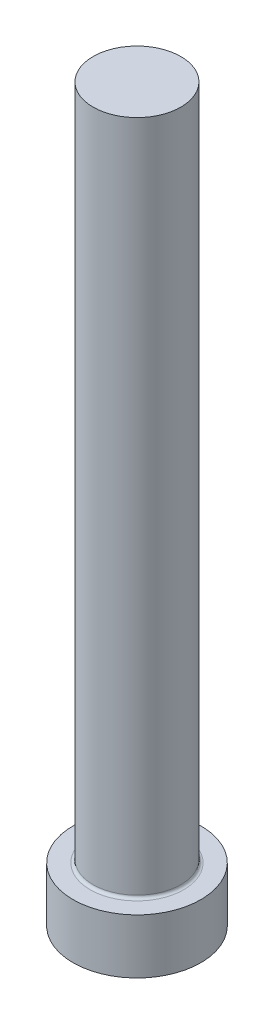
from build123d import *


with BuildPart() as part:
    # Sketch1 → Revolve3 (revolve)
    with BuildSketch(Plane.XY, mode=Mode.PRIVATE) as revolve3_sk:
        with BuildLine():
            Line((0, 0), (5.5499, 0))
            Line((5.5499, 0), (5.5499, 4.7498))
            Line((5.5499, 4.7498), (4.064, 4.7498))
            ThreePointArc((4.064, 4.7498), (3.884394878, 4.824194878), (3.81, 5.0038))
            Line((3.81, 5.0038), (3.81, 63.5))
            Line((3.81, 63.5), (0, 63.5))
            Line((0, 63.5), (0, 0))
        make_face()
    revolve(revolve3_sk.sketch.rotate(Axis((0, 0, 0), (0, -1, 0)), 90), axis=Axis((0, 0, 0), (0, -1, 0)))


solid = part.part
